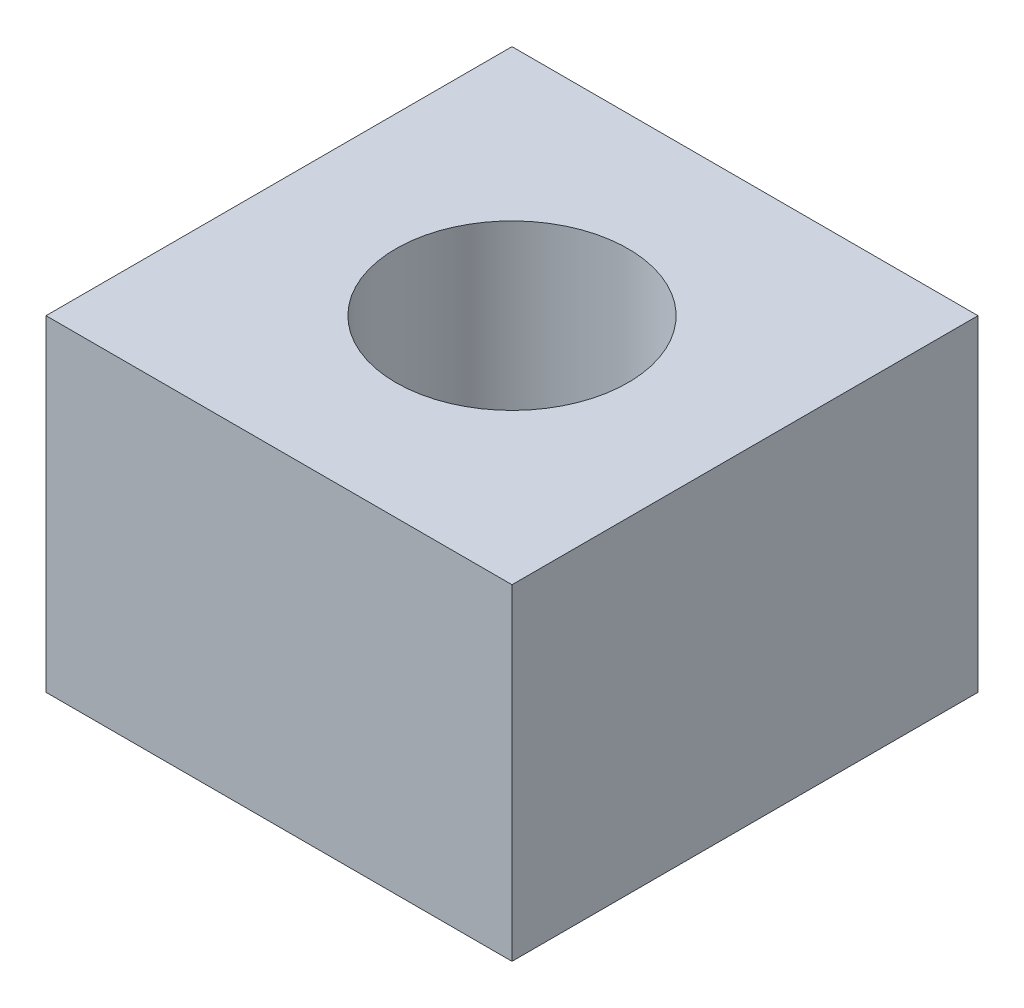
from build123d import *

# Parameters (mm, degrees)
SKETCH_1_W      = 200
SKETCH_1_H      = 200
SKETCH_1_R      = 49.816685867
EXTRUDE_1_DEPTH = 140


with BuildPart() as part:
    # Sketch 1 → Extrude 1 (new body)
    with BuildSketch(Plane(origin=(0, 0, 0), x_dir=(1, 0, 0), z_dir=(0, 1, 0))):
        with Locations((-4.347826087, -16.847826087)):
            Rectangle(SKETCH_1_W, SKETCH_1_H)
        with Locations(Location((-4.347826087, -16.847826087, 0), (0, 0, 270))):
            Circle(SKETCH_1_R, mode=Mode.SUBTRACT)
    extrude(amount=EXTRUDE_1_DEPTH)


solid = part.part
